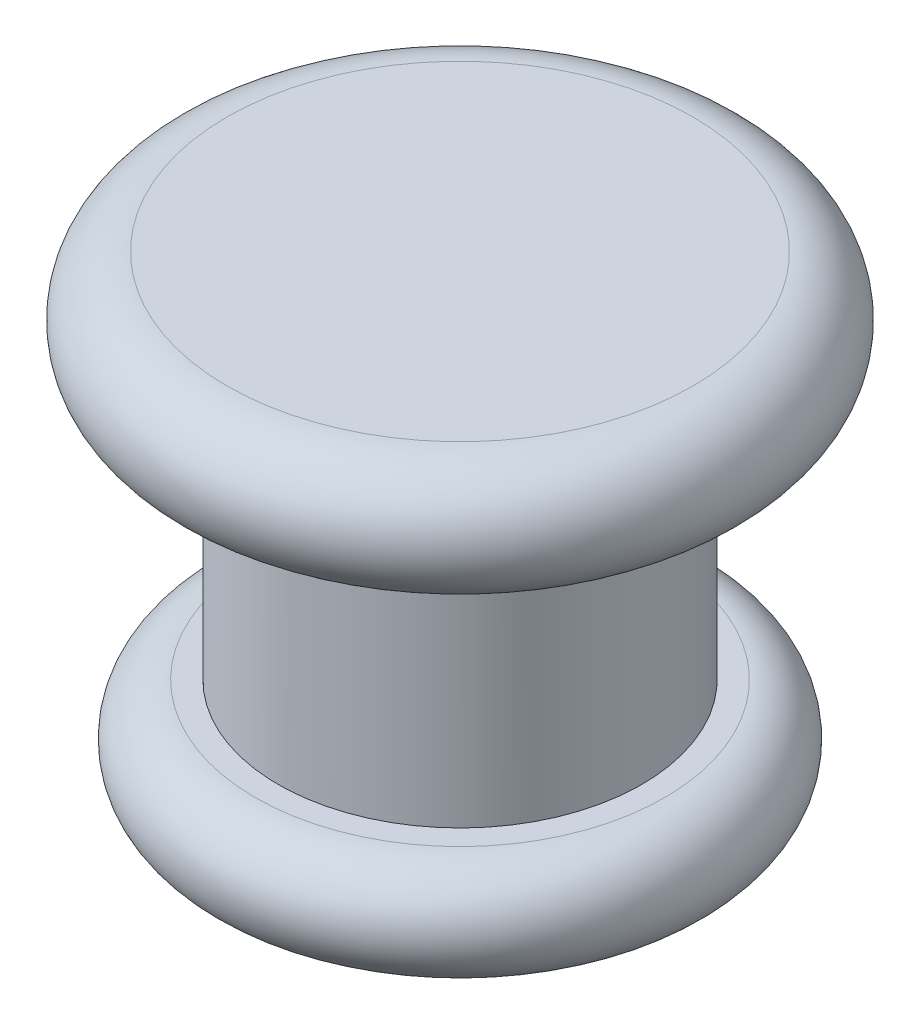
ISO-10303-21;
HEADER;
FILE_DESCRIPTION(('STEP AP214'),'2;1');
FILE_NAME('part.step','',(''),(''),'','','');
FILE_SCHEMA(('AUTOMOTIVE_DESIGN { 1 0 10303 214 1 1 1 1 }'));
ENDSEC;
DATA;
#1=APPLICATION_CONTEXT('core data for automotive mechanical design processes');
#2=APPLICATION_PROTOCOL_DEFINITION('international standard','automotive_design',2000,#1);
#3=PRODUCT_CONTEXT('',#1,'mechanical');
#4=PRODUCT('Part','Part','',(#3));
#5=PRODUCT_RELATED_PRODUCT_CATEGORY('part','',(#4));
#6=PRODUCT_DEFINITION_FORMATION('','',#4);
#7=PRODUCT_DEFINITION_CONTEXT('part definition',#1,'design');
#8=PRODUCT_DEFINITION('design','',#6,#7);
#9=PRODUCT_DEFINITION_SHAPE('','',#8);
#10=(LENGTH_UNIT() NAMED_UNIT(*) SI_UNIT(.MILLI.,.METRE.));
#11=(NAMED_UNIT(*) PLANE_ANGLE_UNIT() SI_UNIT($,.RADIAN.));
#12=(NAMED_UNIT(*) SI_UNIT($,.STERADIAN.) SOLID_ANGLE_UNIT());
#13=UNCERTAINTY_MEASURE_WITH_UNIT(LENGTH_MEASURE(1.E-05),#10,'distance_accuracy_value','');
#14=(GEOMETRIC_REPRESENTATION_CONTEXT(3) GLOBAL_UNCERTAINTY_ASSIGNED_CONTEXT((#13)) GLOBAL_UNIT_ASSIGNED_CONTEXT((#10,
#11,#12)) REPRESENTATION_CONTEXT('',''));
#15=CARTESIAN_POINT('',(0.,0.,0.));
#16=DIRECTION('',(0.,0.,1.));
#17=DIRECTION('',(1.,0.,0.));
#18=AXIS2_PLACEMENT_3D('',#15,#16,#17);
#19=CARTESIAN_POINT('',(0.,-15.3924,0.));
#20=DIRECTION('',(0.,1.,0.));
#21=DIRECTION('',(0.,0.,1.));
#22=AXIS2_PLACEMENT_3D('',#19,#20,#21);
#23=PLANE('',#22);
#24=CARTESIAN_POINT('',(0.,-15.3924,0.));
#25=DIRECTION('',(0.,1.,0.));
#26=DIRECTION('',(0.,0.,1.));
#27=AXIS2_PLACEMENT_3D('',#24,#25,#26);
#28=CIRCLE('',#27,8.89);
#29=CARTESIAN_POINT('',(0.,-15.3924,8.89));
#30=VERTEX_POINT('',#29);
#31=EDGE_CURVE('E103',#30,#30,#28,.T.);
#32=ORIENTED_EDGE('',*,*,#31,.F.);
#33=EDGE_LOOP('',(#32));
#34=FACE_BOUND('',#33,.T.);
#35=ADVANCED_FACE('F14',(#34),#23,.F.);
#36=CARTESIAN_POINT('',(0.,-13.1699,0.));
#37=DIRECTION('',(0.,1.,0.));
#38=DIRECTION('',(0.,0.,1.));
#39=AXIS2_PLACEMENT_3D('',#36,#37,#38);
#40=TOROIDAL_SURFACE('',#39,8.89,2.2225);
#41=CARTESIAN_POINT('',(0.,-10.9474,0.));
#42=DIRECTION('',(0.,-1.,0.));
#43=DIRECTION('',(0.,0.,1.));
#44=AXIS2_PLACEMENT_3D('',#41,#42,#43);
#45=CIRCLE('',#44,8.89);
#46=CARTESIAN_POINT('',(0.,-10.9474,8.89));
#47=VERTEX_POINT('',#46);
#48=EDGE_CURVE('E41',#47,#47,#45,.T.);
#49=ORIENTED_EDGE('',*,*,#48,.T.);
#50=EDGE_LOOP('',(#49));
#51=FACE_BOUND('',#50,.T.);
#52=ORIENTED_EDGE('',*,*,#31,.T.);
#53=EDGE_LOOP('',(#52));
#54=FACE_BOUND('',#53,.T.);
#55=ADVANCED_FACE('F75',(#51,#54),#40,.T.);
#56=CARTESIAN_POINT('',(8.89,-10.9474,0.));
#57=DIRECTION('',(0.,-1.,0.));
#58=DIRECTION('',(0.,0.,-1.));
#59=AXIS2_PLACEMENT_3D('',#56,#57,#58);
#60=PLANE('',#59);
#61=CARTESIAN_POINT('',(0.,-10.9474,0.));
#62=DIRECTION('',(0.,-1.,0.));
#63=DIRECTION('',(0.,0.,-1.));
#64=AXIS2_PLACEMENT_3D('',#61,#62,#63);
#65=CIRCLE('',#64,7.8994);
#66=CARTESIAN_POINT('',(0.,-10.9474,-7.8994));
#67=VERTEX_POINT('',#66);
#68=EDGE_CURVE('E18',#67,#67,#65,.F.);
#69=ORIENTED_EDGE('',*,*,#68,.F.);
#70=EDGE_LOOP('',(#69));
#71=FACE_BOUND('',#70,.T.);
#72=ORIENTED_EDGE('',*,*,#48,.F.);
#73=EDGE_LOOP('',(#72));
#74=FACE_BOUND('',#73,.T.);
#75=ADVANCED_FACE('F71',(#71,#74),#60,.F.);
#76=CARTESIAN_POINT('',(0.,-45.2903007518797,0.));
#77=DIRECTION('',(0.,-1.,0.));
#78=DIRECTION('',(0.,0.,-1.));
#79=AXIS2_PLACEMENT_3D('',#76,#77,#78);
#80=CYLINDRICAL_SURFACE('',#79,7.8994);
#81=ORIENTED_EDGE('',*,*,#68,.T.);
#82=EDGE_LOOP('',(#81));
#83=FACE_BOUND('',#82,.T.);
#84=CARTESIAN_POINT('',(0.,-0.762,0.));
#85=DIRECTION('',(0.,1.,0.));
#86=DIRECTION('',(0.,0.,1.));
#87=AXIS2_PLACEMENT_3D('',#84,#85,#86);
#88=CIRCLE('',#87,7.8994);
#89=CARTESIAN_POINT('',(0.,-0.762,7.8994));
#90=VERTEX_POINT('',#89);
#91=EDGE_CURVE('E32',#90,#90,#88,.F.);
#92=ORIENTED_EDGE('',*,*,#91,.T.);
#93=EDGE_LOOP('',(#92));
#94=FACE_BOUND('',#93,.T.);
#95=ADVANCED_FACE('F65',(#83,#94),#80,.T.);
#96=CARTESIAN_POINT('',(0.,-0.762,0.));
#97=DIRECTION('',(0.,1.,0.));
#98=DIRECTION('',(0.,0.,1.));
#99=AXIS2_PLACEMENT_3D('',#96,#97,#98);
#100=TOROIDAL_SURFACE('',#99,8.6614,0.762);
#101=ORIENTED_EDGE('',*,*,#91,.F.);
#102=EDGE_LOOP('',(#101));
#103=FACE_BOUND('',#102,.T.);
#104=CARTESIAN_POINT('',(0.,0.,0.));
#105=DIRECTION('',(0.,-1.,0.));
#106=DIRECTION('',(-1.,0.,0.));
#107=AXIS2_PLACEMENT_3D('',#104,#105,#106);
#108=CIRCLE('',#107,8.6614);
#109=CARTESIAN_POINT('',(-8.6614,0.,0.));
#110=VERTEX_POINT('',#109);
#111=EDGE_CURVE('E27',#110,#110,#108,.T.);
#112=ORIENTED_EDGE('',*,*,#111,.T.);
#113=EDGE_LOOP('',(#112));
#114=FACE_BOUND('',#113,.T.);
#115=ADVANCED_FACE('F54',(#103,#114),#100,.F.);
#116=CARTESIAN_POINT('',(0.,5.1562,0.));
#117=DIRECTION('',(0.,-1.,0.));
#118=DIRECTION('',(0.,0.,-1.));
#119=AXIS2_PLACEMENT_3D('',#116,#117,#118);
#120=PLANE('',#119);
#121=CARTESIAN_POINT('',(0.,5.1562,0.));
#122=DIRECTION('',(0.,-1.,0.));
#123=DIRECTION('',(1.,0.,0.));
#124=AXIS2_PLACEMENT_3D('',#121,#122,#123);
#125=CIRCLE('',#124,10.1219);
#126=CARTESIAN_POINT('',(10.1219,5.1562,0.));
#127=VERTEX_POINT('',#126);
#128=EDGE_CURVE('E22',#127,#127,#125,.T.);
#129=ORIENTED_EDGE('',*,*,#128,.F.);
#130=EDGE_LOOP('',(#129));
#131=FACE_BOUND('',#130,.T.);
#132=ADVANCED_FACE('F64',(#131),#120,.F.);
#133=CARTESIAN_POINT('',(-10.1219,0.,0.));
#134=DIRECTION('',(0.,1.,0.));
#135=DIRECTION('',(0.,0.,1.));
#136=AXIS2_PLACEMENT_3D('',#133,#134,#135);
#137=PLANE('',#136);
#138=ORIENTED_EDGE('',*,*,#111,.F.);
#139=EDGE_LOOP('',(#138));
#140=FACE_BOUND('',#139,.T.);
#141=CARTESIAN_POINT('',(0.,0.,0.));
#142=DIRECTION('',(0.,1.,0.));
#143=DIRECTION('',(1.,0.,0.));
#144=AXIS2_PLACEMENT_3D('',#141,#142,#143);
#145=CIRCLE('',#144,10.1219);
#146=CARTESIAN_POINT('',(10.1219,0.,0.));
#147=VERTEX_POINT('',#146);
#148=EDGE_CURVE('E10',#147,#147,#145,.T.);
#149=ORIENTED_EDGE('',*,*,#148,.F.);
#150=EDGE_LOOP('',(#149));
#151=FACE_BOUND('',#150,.T.);
#152=ADVANCED_FACE('F127',(#140,#151),#137,.F.);
#153=CARTESIAN_POINT('',(0.,2.5781,0.));
#154=DIRECTION('',(0.,-1.,0.));
#155=DIRECTION('',(0.,0.,-1.));
#156=AXIS2_PLACEMENT_3D('',#153,#154,#155);
#157=TOROIDAL_SURFACE('',#156,10.1219,2.5781);
#158=ORIENTED_EDGE('',*,*,#148,.T.);
#159=EDGE_LOOP('',(#158));
#160=FACE_BOUND('',#159,.T.);
#161=ORIENTED_EDGE('',*,*,#128,.T.);
#162=EDGE_LOOP('',(#161));
#163=FACE_BOUND('',#162,.T.);
#164=ADVANCED_FACE('F125',(#160,#163),#157,.T.);
#165=CLOSED_SHELL('',(#35,#55,#75,#95,#115,#132,#152,#164));
#166=MANIFOLD_SOLID_BREP('B1',#165);
#167=ADVANCED_BREP_SHAPE_REPRESENTATION('',(#18,#166),#14);
#168=SHAPE_DEFINITION_REPRESENTATION(#9,#167);
ENDSEC;
END-ISO-10303-21;
